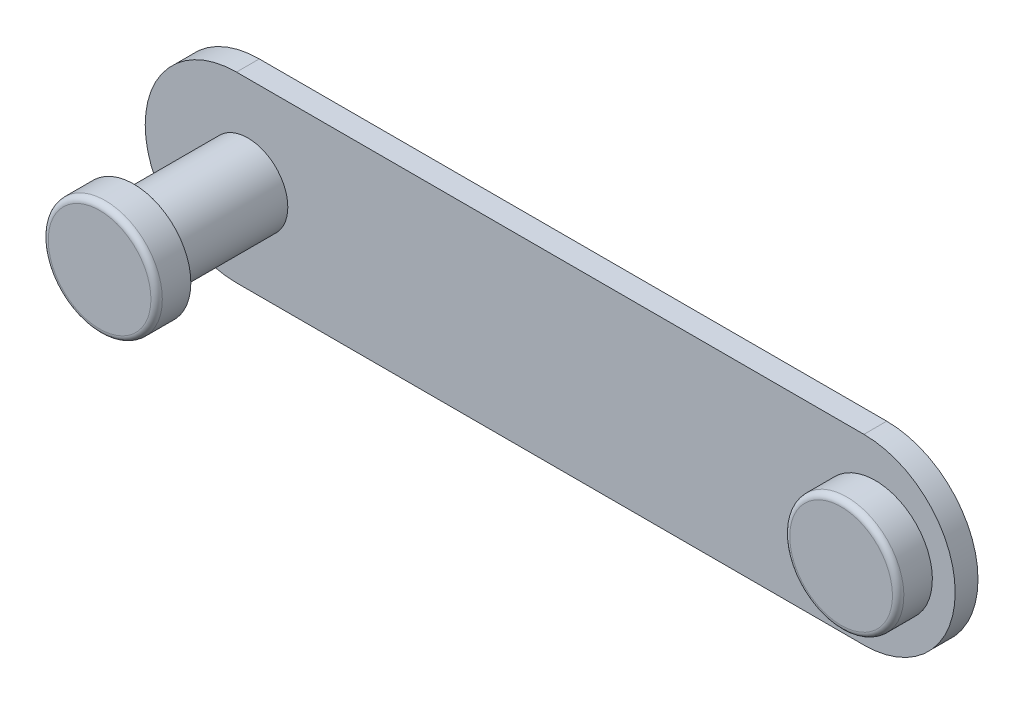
ISO-10303-21;
HEADER;
FILE_DESCRIPTION(('STEP AP214'),'2;1');
FILE_NAME('part.step','',(''),(''),'','','');
FILE_SCHEMA(('AUTOMOTIVE_DESIGN { 1 0 10303 214 1 1 1 1 }'));
ENDSEC;
DATA;
#1=APPLICATION_CONTEXT('core data for automotive mechanical design processes');
#2=APPLICATION_PROTOCOL_DEFINITION('international standard','automotive_design',2000,#1);
#3=PRODUCT_CONTEXT('',#1,'mechanical');
#4=PRODUCT('Part','Part','',(#3));
#5=PRODUCT_RELATED_PRODUCT_CATEGORY('part','',(#4));
#6=PRODUCT_DEFINITION_FORMATION('','',#4);
#7=PRODUCT_DEFINITION_CONTEXT('part definition',#1,'design');
#8=PRODUCT_DEFINITION('design','',#6,#7);
#9=PRODUCT_DEFINITION_SHAPE('','',#8);
#10=(LENGTH_UNIT() NAMED_UNIT(*) SI_UNIT(.MILLI.,.METRE.));
#11=(NAMED_UNIT(*) PLANE_ANGLE_UNIT() SI_UNIT($,.RADIAN.));
#12=(NAMED_UNIT(*) SI_UNIT($,.STERADIAN.) SOLID_ANGLE_UNIT());
#13=UNCERTAINTY_MEASURE_WITH_UNIT(LENGTH_MEASURE(1.E-05),#10,'distance_accuracy_value','');
#14=(GEOMETRIC_REPRESENTATION_CONTEXT(3) GLOBAL_UNCERTAINTY_ASSIGNED_CONTEXT((#13)) GLOBAL_UNIT_ASSIGNED_CONTEXT((#10,
#11,#12)) REPRESENTATION_CONTEXT('',''));
#15=CARTESIAN_POINT('',(0.,0.,0.));
#16=DIRECTION('',(0.,0.,1.));
#17=DIRECTION('',(1.,0.,0.));
#18=AXIS2_PLACEMENT_3D('',#15,#16,#17);
#19=CARTESIAN_POINT('',(-56.,0.,2.));
#20=DIRECTION('',(0.,0.,1.));
#21=DIRECTION('',(1.,0.,0.));
#22=AXIS2_PLACEMENT_3D('',#19,#20,#21);
#23=PLANE('',#22);
#24=CARTESIAN_POINT('',(0.,0.,2.));
#25=DIRECTION('',(0.,0.,1.));
#26=DIRECTION('',(0.,-1.,0.));
#27=AXIS2_PLACEMENT_3D('',#24,#25,#26);
#28=CIRCLE('',#27,5.);
#29=CARTESIAN_POINT('',(0.,-5.,2.));
#30=VERTEX_POINT('',#29);
#31=EDGE_CURVE('E117',#30,#30,#28,.T.);
#32=ORIENTED_EDGE('',*,*,#31,.F.);
#33=EDGE_LOOP('',(#32));
#34=FACE_BOUND('',#33,.T.);
#35=CARTESIAN_POINT('',(-56.,0.,2.));
#36=DIRECTION('',(0.,0.,1.));
#37=DIRECTION('',(1.,0.,0.));
#38=AXIS2_PLACEMENT_3D('',#35,#36,#37);
#39=CIRCLE('',#38,8.);
#40=CARTESIAN_POINT('',(-56.,8.,2.));
#41=VERTEX_POINT('',#40);
#42=CARTESIAN_POINT('',(-56.,-8.,2.));
#43=VERTEX_POINT('',#42);
#44=EDGE_CURVE('E86',#41,#43,#39,.T.);
#45=ORIENTED_EDGE('',*,*,#44,.T.);
#46=DIRECTION('',(1.,0.,0.));
#47=VECTOR('',#46,1.);
#48=CARTESIAN_POINT('',(-56.,-8.,2.));
#49=LINE('',#48,#47);
#50=CARTESIAN_POINT('',(-1.,-8.,2.));
#51=VERTEX_POINT('',#50);
#52=EDGE_CURVE('E81',#43,#51,#49,.T.);
#53=ORIENTED_EDGE('',*,*,#52,.T.);
#54=CARTESIAN_POINT('',(-1.,0.,2.));
#55=DIRECTION('',(0.,0.,1.));
#56=DIRECTION('',(1.,0.,0.));
#57=AXIS2_PLACEMENT_3D('',#54,#55,#56);
#58=CIRCLE('',#57,8.);
#59=CARTESIAN_POINT('',(-1.,8.,2.));
#60=VERTEX_POINT('',#59);
#61=EDGE_CURVE('E84',#51,#60,#58,.T.);
#62=ORIENTED_EDGE('',*,*,#61,.T.);
#63=DIRECTION('',(-1.,0.,0.));
#64=VECTOR('',#63,1.);
#65=CARTESIAN_POINT('',(-1.,8.,2.));
#66=LINE('',#65,#64);
#67=EDGE_CURVE('E51',#60,#41,#66,.T.);
#68=ORIENTED_EDGE('',*,*,#67,.T.);
#69=EDGE_LOOP('',(#45,#53,#62,#68));
#70=FACE_BOUND('',#69,.T.);
#71=CARTESIAN_POINT('',(-55.,0.,2.));
#72=DIRECTION('',(0.,0.,1.));
#73=DIRECTION('',(1.,0.,0.));
#74=AXIS2_PLACEMENT_3D('',#71,#72,#73);
#75=CIRCLE('',#74,3.5);
#76=CARTESIAN_POINT('',(-51.5,0.,2.));
#77=VERTEX_POINT('',#76);
#78=EDGE_CURVE('E132',#77,#77,#75,.T.);
#79=ORIENTED_EDGE('',*,*,#78,.F.);
#80=EDGE_LOOP('',(#79));
#81=FACE_BOUND('',#80,.T.);
#82=ADVANCED_FACE('F34',(#34,#70,#81),#23,.T.);
#83=CARTESIAN_POINT('',(-56.,0.,2.));
#84=DIRECTION('',(0.,0.,-1.));
#85=DIRECTION('',(-1.,0.,0.));
#86=AXIS2_PLACEMENT_3D('',#83,#84,#85);
#87=CYLINDRICAL_SURFACE('',#86,8.);
#88=CARTESIAN_POINT('',(-56.,0.,0.));
#89=DIRECTION('',(0.,0.,1.));
#90=DIRECTION('',(1.,0.,0.));
#91=AXIS2_PLACEMENT_3D('',#88,#89,#90);
#92=CIRCLE('',#91,8.);
#93=CARTESIAN_POINT('',(-56.,8.,0.));
#94=VERTEX_POINT('',#93);
#95=CARTESIAN_POINT('',(-56.,-8.,0.));
#96=VERTEX_POINT('',#95);
#97=EDGE_CURVE('E98',#94,#96,#92,.T.);
#98=ORIENTED_EDGE('',*,*,#97,.T.);
#99=DIRECTION('',(0.,0.,-1.));
#100=VECTOR('',#99,1.);
#101=CARTESIAN_POINT('',(-56.,-8.,2.));
#102=LINE('',#101,#100);
#103=EDGE_CURVE('E11',#43,#96,#102,.T.);
#104=ORIENTED_EDGE('',*,*,#103,.F.);
#105=ORIENTED_EDGE('',*,*,#44,.F.);
#106=DIRECTION('',(0.,0.,-1.));
#107=VECTOR('',#106,1.);
#108=CARTESIAN_POINT('',(-56.,8.,2.));
#109=LINE('',#108,#107);
#110=EDGE_CURVE('E94',#41,#94,#109,.T.);
#111=ORIENTED_EDGE('',*,*,#110,.T.);
#112=EDGE_LOOP('',(#98,#104,#105,#111));
#113=FACE_BOUND('',#112,.T.);
#114=ADVANCED_FACE('F36',(#113),#87,.T.);
#115=CARTESIAN_POINT('',(-56.,-8.,2.));
#116=DIRECTION('',(0.,1.,0.));
#117=DIRECTION('',(0.,0.,1.));
#118=AXIS2_PLACEMENT_3D('',#115,#116,#117);
#119=PLANE('',#118);
#120=DIRECTION('',(1.,0.,0.));
#121=VECTOR('',#120,1.);
#122=CARTESIAN_POINT('',(-56.,-8.,0.));
#123=LINE('',#122,#121);
#124=CARTESIAN_POINT('',(-1.,-8.,0.));
#125=VERTEX_POINT('',#124);
#126=EDGE_CURVE('E90',#96,#125,#123,.T.);
#127=ORIENTED_EDGE('',*,*,#126,.T.);
#128=DIRECTION('',(0.,0.,-1.));
#129=VECTOR('',#128,1.);
#130=CARTESIAN_POINT('',(-1.,-8.,2.));
#131=LINE('',#130,#129);
#132=EDGE_CURVE('E43',#51,#125,#131,.T.);
#133=ORIENTED_EDGE('',*,*,#132,.F.);
#134=ORIENTED_EDGE('',*,*,#52,.F.);
#135=ORIENTED_EDGE('',*,*,#103,.T.);
#136=EDGE_LOOP('',(#127,#133,#134,#135));
#137=FACE_BOUND('',#136,.T.);
#138=ADVANCED_FACE('F89',(#137),#119,.F.);
#139=CARTESIAN_POINT('',(-1.,0.,2.));
#140=DIRECTION('',(0.,0.,-1.));
#141=DIRECTION('',(-1.,0.,0.));
#142=AXIS2_PLACEMENT_3D('',#139,#140,#141);
#143=CYLINDRICAL_SURFACE('',#142,8.);
#144=CARTESIAN_POINT('',(-1.,0.,0.));
#145=DIRECTION('',(0.,0.,1.));
#146=DIRECTION('',(1.,0.,0.));
#147=AXIS2_PLACEMENT_3D('',#144,#145,#146);
#148=CIRCLE('',#147,8.);
#149=CARTESIAN_POINT('',(-1.,8.,0.));
#150=VERTEX_POINT('',#149);
#151=EDGE_CURVE('E68',#125,#150,#148,.T.);
#152=ORIENTED_EDGE('',*,*,#151,.T.);
#153=DIRECTION('',(0.,0.,-1.));
#154=VECTOR('',#153,1.);
#155=CARTESIAN_POINT('',(-1.,8.,2.));
#156=LINE('',#155,#154);
#157=EDGE_CURVE('E91',#60,#150,#156,.T.);
#158=ORIENTED_EDGE('',*,*,#157,.F.);
#159=ORIENTED_EDGE('',*,*,#61,.F.);
#160=ORIENTED_EDGE('',*,*,#132,.T.);
#161=EDGE_LOOP('',(#152,#158,#159,#160));
#162=FACE_BOUND('',#161,.T.);
#163=ADVANCED_FACE('F92',(#162),#143,.T.);
#164=CARTESIAN_POINT('',(-1.,8.,2.));
#165=DIRECTION('',(0.,-1.,0.));
#166=DIRECTION('',(0.,0.,-1.));
#167=AXIS2_PLACEMENT_3D('',#164,#165,#166);
#168=PLANE('',#167);
#169=DIRECTION('',(-1.,0.,0.));
#170=VECTOR('',#169,1.);
#171=CARTESIAN_POINT('',(-1.,8.,0.));
#172=LINE('',#171,#170);
#173=EDGE_CURVE('E74',#150,#94,#172,.T.);
#174=ORIENTED_EDGE('',*,*,#173,.T.);
#175=ORIENTED_EDGE('',*,*,#110,.F.);
#176=ORIENTED_EDGE('',*,*,#67,.F.);
#177=ORIENTED_EDGE('',*,*,#157,.T.);
#178=EDGE_LOOP('',(#174,#175,#176,#177));
#179=FACE_BOUND('',#178,.T.);
#180=ADVANCED_FACE('F106',(#179),#168,.F.);
#181=CARTESIAN_POINT('',(-56.,0.,0.));
#182=DIRECTION('',(0.,0.,1.));
#183=DIRECTION('',(1.,0.,0.));
#184=AXIS2_PLACEMENT_3D('',#181,#182,#183);
#185=PLANE('',#184);
#186=ORIENTED_EDGE('',*,*,#97,.F.);
#187=ORIENTED_EDGE('',*,*,#173,.F.);
#188=ORIENTED_EDGE('',*,*,#151,.F.);
#189=ORIENTED_EDGE('',*,*,#126,.F.);
#190=EDGE_LOOP('',(#186,#187,#188,#189));
#191=FACE_BOUND('',#190,.T.);
#192=ADVANCED_FACE('F109',(#191),#185,.F.);
#193=CARTESIAN_POINT('',(0.,0.,5.));
#194=DIRECTION('',(0.,0.,-1.));
#195=DIRECTION('',(0.,1.,0.));
#196=AXIS2_PLACEMENT_3D('',#193,#194,#195);
#197=PLANE('',#196);
#198=CARTESIAN_POINT('',(0.,0.,5.));
#199=DIRECTION('',(0.,0.,1.));
#200=DIRECTION('',(0.,-1.,0.));
#201=AXIS2_PLACEMENT_3D('',#198,#199,#200);
#202=CIRCLE('',#201,4.5);
#203=CARTESIAN_POINT('',(0.,-4.5,5.));
#204=VERTEX_POINT('',#203);
#205=EDGE_CURVE('E101',#204,#204,#202,.T.);
#206=ORIENTED_EDGE('',*,*,#205,.T.);
#207=EDGE_LOOP('',(#206));
#208=FACE_BOUND('',#207,.T.);
#209=ADVANCED_FACE('F146',(#208),#197,.F.);
#210=CARTESIAN_POINT('',(0.,0.,4.50000000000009));
#211=DIRECTION('',(0.,0.,1.));
#212=DIRECTION('',(0.,-1.,0.));
#213=AXIS2_PLACEMENT_3D('',#210,#211,#212);
#214=TOROIDAL_SURFACE('',#213,4.50000000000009,0.499999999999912);
#215=ORIENTED_EDGE('',*,*,#205,.F.);
#216=EDGE_LOOP('',(#215));
#217=FACE_BOUND('',#216,.T.);
#218=CARTESIAN_POINT('',(0.,0.,4.5));
#219=DIRECTION('',(0.,0.,1.));
#220=DIRECTION('',(0.,-1.,0.));
#221=AXIS2_PLACEMENT_3D('',#218,#219,#220);
#222=CIRCLE('',#221,5.);
#223=CARTESIAN_POINT('',(0.,-5.,4.5));
#224=VERTEX_POINT('',#223);
#225=EDGE_CURVE('E114',#224,#224,#222,.T.);
#226=ORIENTED_EDGE('',*,*,#225,.T.);
#227=EDGE_LOOP('',(#226));
#228=FACE_BOUND('',#227,.T.);
#229=ADVANCED_FACE('F176',(#217,#228),#214,.T.);
#230=CARTESIAN_POINT('',(0.,0.,2.));
#231=DIRECTION('',(0.,0.,1.));
#232=DIRECTION('',(0.,-1.,0.));
#233=AXIS2_PLACEMENT_3D('',#230,#231,#232);
#234=CYLINDRICAL_SURFACE('',#233,5.);
#235=ORIENTED_EDGE('',*,*,#225,.F.);
#236=EDGE_LOOP('',(#235));
#237=FACE_BOUND('',#236,.T.);
#238=ORIENTED_EDGE('',*,*,#31,.T.);
#239=EDGE_LOOP('',(#238));
#240=FACE_BOUND('',#239,.T.);
#241=ADVANCED_FACE('F183',(#237,#240),#234,.T.);
#242=CARTESIAN_POINT('',(-55.,0.,15.));
#243=DIRECTION('',(0.,0.,-1.));
#244=DIRECTION('',(-1.,0.,0.));
#245=AXIS2_PLACEMENT_3D('',#242,#243,#244);
#246=PLANE('',#245);
#247=CARTESIAN_POINT('',(-55.,0.,15.));
#248=DIRECTION('',(0.,0.,1.));
#249=DIRECTION('',(1.,0.,0.));
#250=AXIS2_PLACEMENT_3D('',#247,#248,#249);
#251=CIRCLE('',#250,4.5);
#252=CARTESIAN_POINT('',(-50.5,0.,15.));
#253=VERTEX_POINT('',#252);
#254=EDGE_CURVE('E120',#253,#253,#251,.T.);
#255=ORIENTED_EDGE('',*,*,#254,.T.);
#256=EDGE_LOOP('',(#255));
#257=FACE_BOUND('',#256,.T.);
#258=ADVANCED_FACE('F190',(#257),#246,.F.);
#259=CARTESIAN_POINT('',(-55.,0.,14.4999999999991));
#260=DIRECTION('',(0.,0.,1.));
#261=DIRECTION('',(1.,0.,0.));
#262=AXIS2_PLACEMENT_3D('',#259,#260,#261);
#263=TOROIDAL_SURFACE('',#262,4.49999999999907,0.500000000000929);
#264=ORIENTED_EDGE('',*,*,#254,.F.);
#265=EDGE_LOOP('',(#264));
#266=FACE_BOUND('',#265,.T.);
#267=CARTESIAN_POINT('',(-55.,0.,14.5));
#268=DIRECTION('',(0.,0.,1.));
#269=DIRECTION('',(1.,0.,0.));
#270=AXIS2_PLACEMENT_3D('',#267,#268,#269);
#271=CIRCLE('',#270,5.);
#272=CARTESIAN_POINT('',(-50.,0.,14.5));
#273=VERTEX_POINT('',#272);
#274=EDGE_CURVE('E123',#273,#273,#271,.T.);
#275=ORIENTED_EDGE('',*,*,#274,.T.);
#276=EDGE_LOOP('',(#275));
#277=FACE_BOUND('',#276,.T.);
#278=ADVANCED_FACE('F198',(#266,#277),#263,.T.);
#279=CARTESIAN_POINT('',(-55.,0.,2.));
#280=DIRECTION('',(0.,0.,1.));
#281=DIRECTION('',(1.,0.,0.));
#282=AXIS2_PLACEMENT_3D('',#279,#280,#281);
#283=CYLINDRICAL_SURFACE('',#282,5.);
#284=ORIENTED_EDGE('',*,*,#274,.F.);
#285=EDGE_LOOP('',(#284));
#286=FACE_BOUND('',#285,.T.);
#287=CARTESIAN_POINT('',(-55.,0.,12.));
#288=DIRECTION('',(0.,0.,1.));
#289=DIRECTION('',(1.,0.,0.));
#290=AXIS2_PLACEMENT_3D('',#287,#288,#289);
#291=CIRCLE('',#290,5.);
#292=CARTESIAN_POINT('',(-50.,0.,12.));
#293=VERTEX_POINT('',#292);
#294=EDGE_CURVE('E126',#293,#293,#291,.T.);
#295=ORIENTED_EDGE('',*,*,#294,.T.);
#296=EDGE_LOOP('',(#295));
#297=FACE_BOUND('',#296,.T.);
#298=ADVANCED_FACE('F206',(#286,#297),#283,.T.);
#299=CARTESIAN_POINT('',(-60.,0.,12.));
#300=DIRECTION('',(0.,0.,1.));
#301=DIRECTION('',(1.,0.,0.));
#302=AXIS2_PLACEMENT_3D('',#299,#300,#301);
#303=PLANE('',#302);
#304=ORIENTED_EDGE('',*,*,#294,.F.);
#305=EDGE_LOOP('',(#304));
#306=FACE_BOUND('',#305,.T.);
#307=CARTESIAN_POINT('',(-55.,0.,12.));
#308=DIRECTION('',(0.,0.,1.));
#309=DIRECTION('',(1.,0.,0.));
#310=AXIS2_PLACEMENT_3D('',#307,#308,#309);
#311=CIRCLE('',#310,3.5);
#312=CARTESIAN_POINT('',(-51.5,0.,12.));
#313=VERTEX_POINT('',#312);
#314=EDGE_CURVE('E129',#313,#313,#311,.T.);
#315=ORIENTED_EDGE('',*,*,#314,.T.);
#316=EDGE_LOOP('',(#315));
#317=FACE_BOUND('',#316,.T.);
#318=ADVANCED_FACE('F214',(#306,#317),#303,.F.);
#319=CARTESIAN_POINT('',(-55.,0.,2.));
#320=DIRECTION('',(0.,0.,1.));
#321=DIRECTION('',(1.,0.,0.));
#322=AXIS2_PLACEMENT_3D('',#319,#320,#321);
#323=CYLINDRICAL_SURFACE('',#322,3.5);
#324=ORIENTED_EDGE('',*,*,#314,.F.);
#325=EDGE_LOOP('',(#324));
#326=FACE_BOUND('',#325,.T.);
#327=ORIENTED_EDGE('',*,*,#78,.T.);
#328=EDGE_LOOP('',(#327));
#329=FACE_BOUND('',#328,.T.);
#330=ADVANCED_FACE('F136',(#326,#329),#323,.T.);
#331=CLOSED_SHELL('',(#82,#114,#138,#163,#180,#192,#209,#229,#241,#258,#278,#298,#318,#330));
#332=MANIFOLD_SOLID_BREP('B2',#331);
#333=ADVANCED_BREP_SHAPE_REPRESENTATION('',(#18,#332),#14);
#334=SHAPE_DEFINITION_REPRESENTATION(#9,#333);
ENDSEC;
END-ISO-10303-21;
